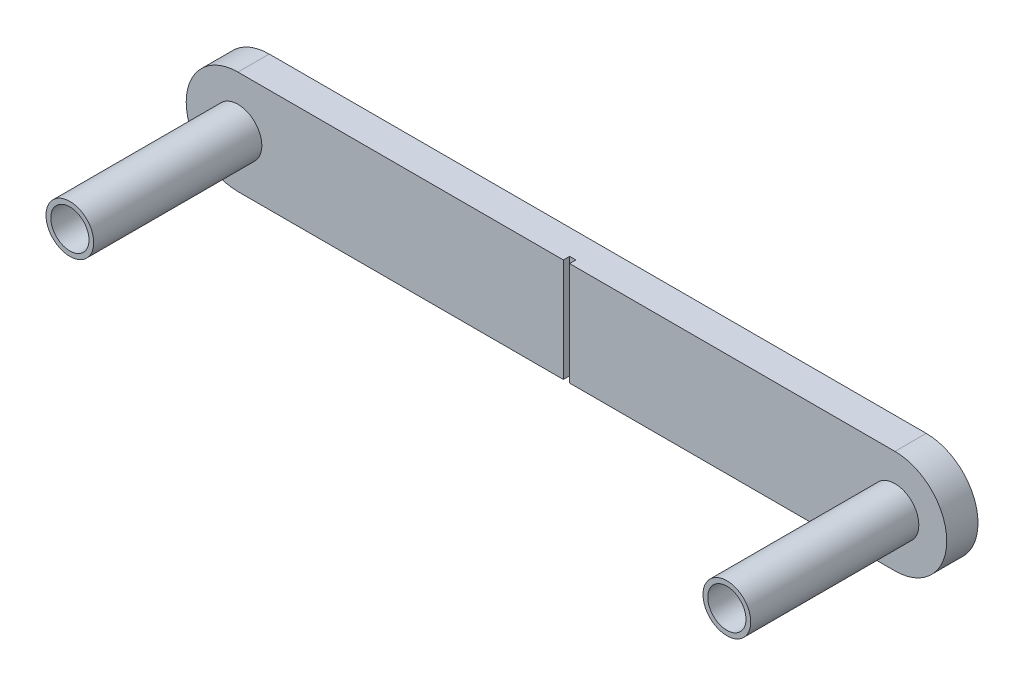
from build123d import *

# Parameters (mm, degrees)
ESQUISSE7_R             = 7.625
BASE_EXTRUSION_DEPTH    = 53.73
BOSS_EXTRU_1_DEPTH      = 10
ESQUISSE10_R            = 7.625
BOSS_EXTRU_2_DEPTH      = 53.73
ESQUISSE11_W            = 2
ESQUISSE11_H            = 33.470165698
ENL_V_MAT_EXTRU_2_DEPTH = 2
ESQUISSE12_R            = 6.11
ENL_V_MAT_EXTRU_3_DEPTH = 408.731933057


with BuildPart() as part:
    # Esquisse7 → Base-Extrusion (new body)
    with BuildSketch(Plane.XY):
        with Locations((353.595340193, 142.140968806)):
            Circle(ESQUISSE7_R)
    extrude(amount=-BASE_EXTRUSION_DEPTH)

    # Esquisse8 → Boss.-Extru.1 (add)
    with BuildSketch(Plane(origin=(0, 0, -53.73), x_dir=(-1, 0, 0), z_dir=(0, 0, -1))):
        with BuildLine():
            Line((-143.595340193, 158.684747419), (-353.595340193, 158.684747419))
            ThreePointArc((-353.595340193, 158.684747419), (-370.139118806, 142.140968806), (-353.595340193, 125.597190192))
            Line((-353.595340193, 125.597190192), (-143.595340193, 125.597190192))
            ThreePointArc((-143.595340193, 125.597190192), (-127.05156158, 142.140968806), (-143.595340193, 158.684747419))
        make_face()
    extrude(amount=BOSS_EXTRU_1_DEPTH)

    # Esquisse10 → Boss.-Extru.2 (add)
    with BuildSketch(Plane.XY.offset(-53.73)):
        with Locations(Location((143.595340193, 142.140968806, 0), (0, 0, 180))):
            Circle(ESQUISSE10_R)
    extrude(amount=BOSS_EXTRU_2_DEPTH)

    # Esquisse11 → Enl_v. mat.-Extru.2 (cut)
    with BuildSketch(Plane.XY.offset(-53.73)):
        with Locations((248.595340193, 141.94966457)):
            Rectangle(ESQUISSE11_W, ESQUISSE11_H)
    extrude(amount=-ENL_V_MAT_EXTRU_2_DEPTH, mode=Mode.SUBTRACT)

    # Esquisse12 → Enl_v. mat.-Extru.3 (cut, through all)
    with BuildSketch(Plane.XY):
        with Locations((143.595340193, 142.140968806)):
            Circle(ESQUISSE12_R)
        with Locations((353.595340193, 142.140968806)):
            Circle(ESQUISSE12_R)
    extrude(amount=-ENL_V_MAT_EXTRU_3_DEPTH, mode=Mode.SUBTRACT)


solid = part.part
